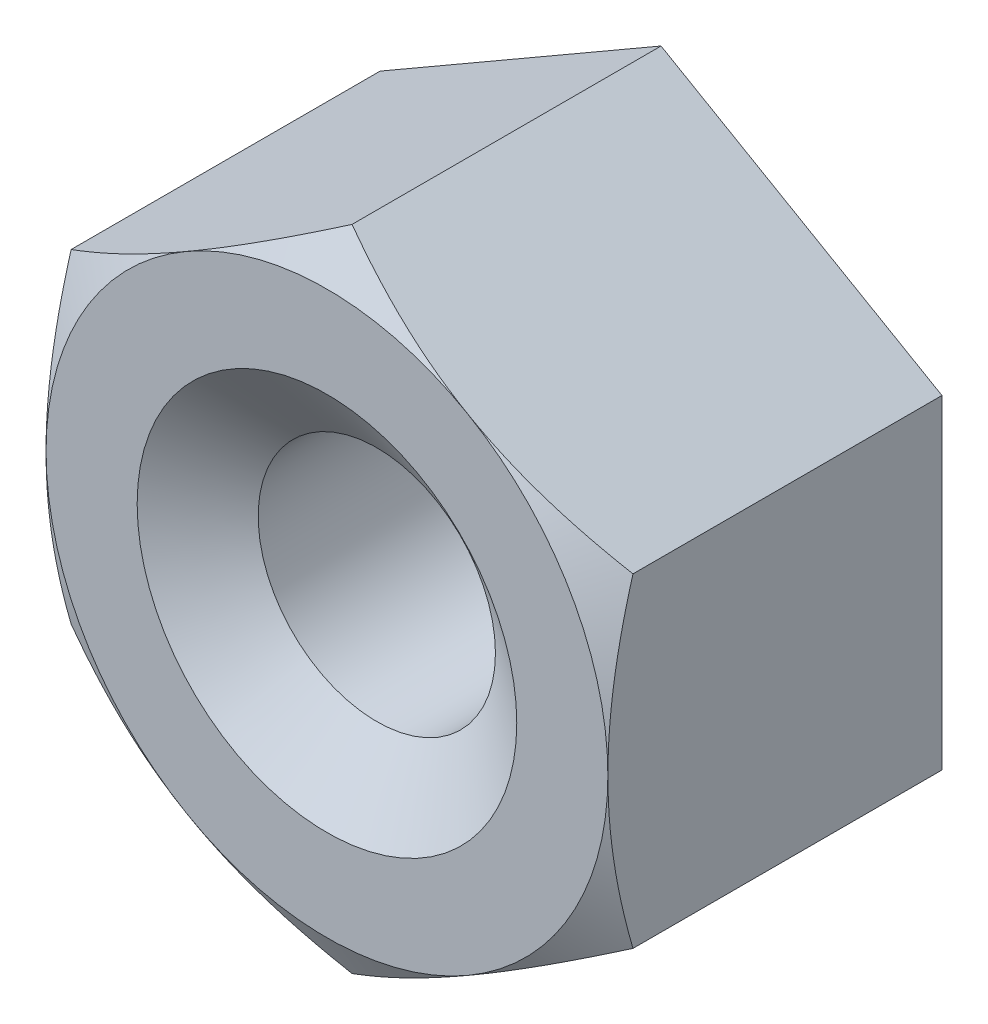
from build123d import *

# Parameters (mm, degrees)
BASENUTSKE_R  = 3.96875
BASENUT_DEPTH = 11.176


with BuildPart() as part:
    # BaseNutSke → BaseNut (new body)
    with BuildSketch(Plane.XY):
        Polygon((9.398, 5.42593783), (9.398, -5.42593783), (0, -10.85187566), (-9.398, -5.42593783), (-9.398, 5.42593783), (0, 10.85187566), align=None)
        Circle(BASENUTSKE_R, mode=Mode.SUBTRACT)
    extrude(amount=-BASENUT_DEPTH)

    # Sketch4 → Single-Chamfer (revolve, cut)
    with BuildSketch(Plane(origin=(0, 0, 0), x_dir=(0, 0, -1), z_dir=(1, 0, 0))):
        Polygon((0, 9.398), (-12.7, 9.398), (-12.7, 23.55187566), (0.839395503, 23.55187566), (0.839395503, 10.85187566), align=None)
    revolve(axis=Axis((0, 0, 0), (0, 0, -1)), mode=Mode.SUBTRACT)

    # EndChamferSketch → EndChamfer (revolve, cut)
    with BuildSketch(Plane(origin=(0, 0, 0), x_dir=(0, 0, -1), z_dir=(1, 0, 0)), mode=Mode.PRIVATE) as endchamfer_sk:
        Polygon((11.1506, 6.35), (9.31649388, 3.730625), (11.2014, 3.730625), (11.2014, 6.35), align=None)
        Polygon((-0.0508, 6.35), (0, 6.35), (1.83410612, 3.730625), (-0.0508, 3.730625), align=None)
    revolve(endchamfer_sk.sketch.rotate(Axis((0, 0, -25.037505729), (0, 0, -1)), 90), axis=Axis((0, 0, -25.037505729), (0, 0, -1)), mode=Mode.SUBTRACT)


solid = part.part
